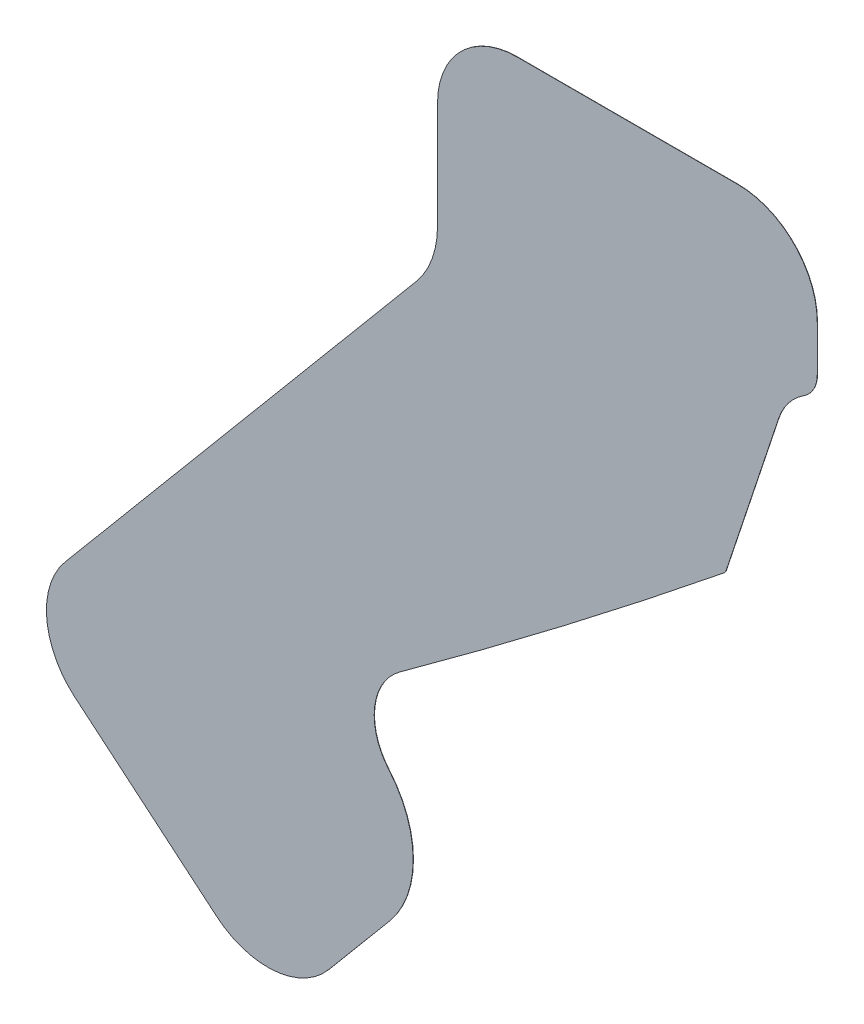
from build123d import *

# Parameters (mm, degrees)
BOSS_EXTRUDE1_DEPTH = 0.0254


with BuildPart() as part:
    # Sketch1 → Boss-Extrude1 (new body)
    with BuildSketch(Plane.XY):
        with BuildLine():
            Line((-509.208498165, -92.700699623), (-503.773839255, -86.223925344))
            ThreePointArc((-503.773839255, -86.223925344), (-501.664344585, -80.389317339), (-503.823704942, -74.572979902))
            ThreePointArc((-503.823704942, -74.572979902), (-505.10788568, -70.331713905), (-502.862456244, -66.511307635))
            ThreePointArc((-502.862456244, -66.511307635), (-488.234122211, -55.624623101), (-473.894642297, -44.360193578))
            ThreePointArc((-473.894642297, -44.360193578), (-473.796222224, -44.254369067), (-473.731583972, -44.125112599))
            Line((-473.731583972, -44.125112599), (-469.037577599, -30.007018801))
            ThreePointArc((-469.037577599, -30.007018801), (-468.164737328, -28.369529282), (-466.798938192, -27.113418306))
            ThreePointArc((-466.798938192, -27.113418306), (-465.905903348, -26.148955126), (-465.582, -24.875068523))
            Line((-465.582, -24.875068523), (-465.582, -20.819194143))
            ThreePointArc((-465.582, -20.819194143), (-467.665056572, -15.790250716), (-472.694, -13.707194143))
            Line((-472.694, -13.707194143), (-492.379, -13.707194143))
            ThreePointArc((-492.379, -13.707194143), (-497.407943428, -15.790250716), (-499.491, -20.819194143))
            Line((-499.491, -20.819194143), (-499.491, -30.347870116))
            ThreePointArc((-499.491, -30.347870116), (-499.981178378, -33.127809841), (-501.392590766, -35.572447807))
            Line((-501.392590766, -35.572447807), (-532.752108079, -72.945265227))
            ThreePointArc((-532.752108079, -72.945265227), (-534.388936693, -78.13662235), (-531.87550548, -82.964878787))
            Line((-531.87550548, -82.964878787), (-519.228111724, -93.577302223))
            ThreePointArc((-519.228111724, -93.577302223), (-514.036754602, -95.214130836), (-509.208498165, -92.700699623))
        make_face()
    extrude(amount=BOSS_EXTRUDE1_DEPTH)


solid = part.part
